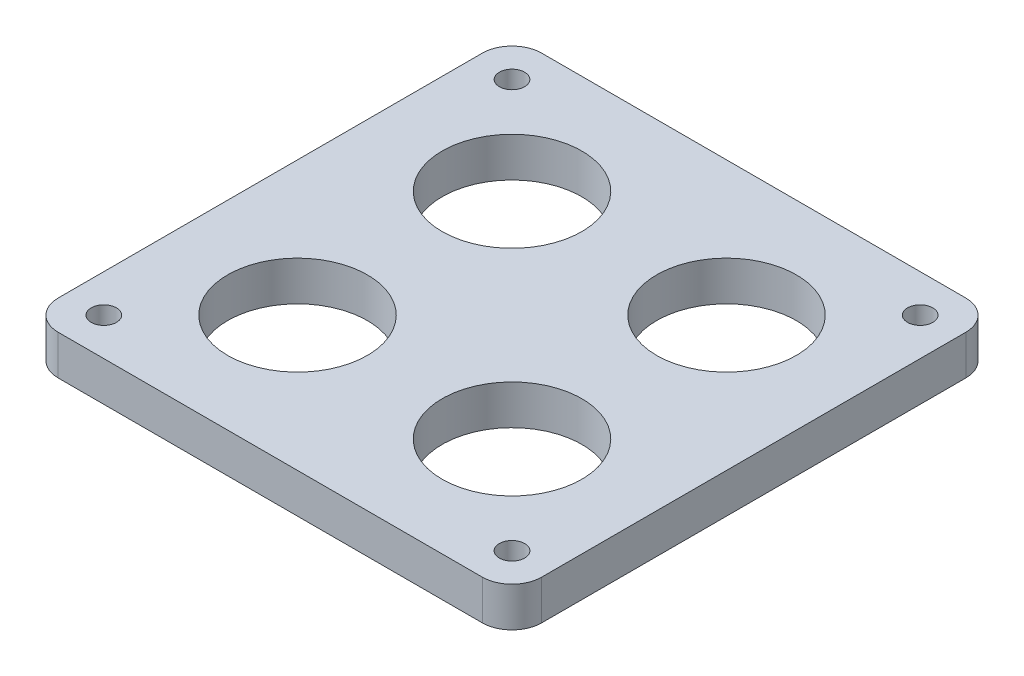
ISO-10303-21;
HEADER;
FILE_DESCRIPTION(('STEP AP214'),'2;1');
FILE_NAME('part.step','',(''),(''),'','','');
FILE_SCHEMA(('AUTOMOTIVE_DESIGN { 1 0 10303 214 1 1 1 1 }'));
ENDSEC;
DATA;
#1=APPLICATION_CONTEXT('core data for automotive mechanical design processes');
#2=APPLICATION_PROTOCOL_DEFINITION('international standard','automotive_design',2000,#1);
#3=PRODUCT_CONTEXT('',#1,'mechanical');
#4=PRODUCT('Part','Part','',(#3));
#5=PRODUCT_RELATED_PRODUCT_CATEGORY('part','',(#4));
#6=PRODUCT_DEFINITION_FORMATION('','',#4);
#7=PRODUCT_DEFINITION_CONTEXT('part definition',#1,'design');
#8=PRODUCT_DEFINITION('design','',#6,#7);
#9=PRODUCT_DEFINITION_SHAPE('','',#8);
#10=(LENGTH_UNIT() NAMED_UNIT(*) SI_UNIT(.MILLI.,.METRE.));
#11=(NAMED_UNIT(*) PLANE_ANGLE_UNIT() SI_UNIT($,.RADIAN.));
#12=(NAMED_UNIT(*) SI_UNIT($,.STERADIAN.) SOLID_ANGLE_UNIT());
#13=UNCERTAINTY_MEASURE_WITH_UNIT(LENGTH_MEASURE(1.E-05),#10,'distance_accuracy_value','');
#14=(GEOMETRIC_REPRESENTATION_CONTEXT(3) GLOBAL_UNCERTAINTY_ASSIGNED_CONTEXT((#13)) GLOBAL_UNIT_ASSIGNED_CONTEXT((#10,
#11,#12)) REPRESENTATION_CONTEXT('',''));
#15=CARTESIAN_POINT('',(0.,0.,0.));
#16=DIRECTION('',(0.,0.,1.));
#17=DIRECTION('',(1.,0.,0.));
#18=AXIS2_PLACEMENT_3D('',#15,#16,#17);
#19=CARTESIAN_POINT('',(0.,-2.,0.));
#20=DIRECTION('',(0.,1.,0.));
#21=DIRECTION('',(0.,0.,1.));
#22=AXIS2_PLACEMENT_3D('',#19,#20,#21);
#23=PLANE('',#22);
#24=CARTESIAN_POINT('',(-10.825,-2.,-10.825));
#25=DIRECTION('',(0.,1.,0.));
#26=DIRECTION('',(0.,0.,1.));
#27=AXIS2_PLACEMENT_3D('',#24,#25,#26);
#28=CIRCLE('',#27,7.05);
#29=CARTESIAN_POINT('',(-10.825,-2.,-3.775));
#30=VERTEX_POINT('',#29);
#31=EDGE_CURVE('P0_E183',#30,#30,#28,.T.);
#32=ORIENTED_EDGE('',*,*,#31,.T.);
#33=EDGE_LOOP('',(#32));
#34=FACE_BOUND('',#33,.T.);
#35=CARTESIAN_POINT('',(10.825,-2.,-10.825));
#36=DIRECTION('',(0.,1.,0.));
#37=DIRECTION('',(0.,0.,1.));
#38=AXIS2_PLACEMENT_3D('',#35,#36,#37);
#39=CIRCLE('',#38,7.05);
#40=CARTESIAN_POINT('',(10.825,-2.,-3.775));
#41=VERTEX_POINT('',#40);
#42=EDGE_CURVE('P0_E187',#41,#41,#39,.T.);
#43=ORIENTED_EDGE('',*,*,#42,.T.);
#44=EDGE_LOOP('',(#43));
#45=FACE_BOUND('',#44,.T.);
#46=CARTESIAN_POINT('',(10.825,-2.,10.825));
#47=DIRECTION('',(0.,1.,0.));
#48=DIRECTION('',(0.,0.,1.));
#49=AXIS2_PLACEMENT_3D('',#46,#47,#48);
#50=CIRCLE('',#49,7.05);
#51=CARTESIAN_POINT('',(10.825,-2.,17.875));
#52=VERTEX_POINT('',#51);
#53=EDGE_CURVE('P0_E191',#52,#52,#50,.T.);
#54=ORIENTED_EDGE('',*,*,#53,.T.);
#55=EDGE_LOOP('',(#54));
#56=FACE_BOUND('',#55,.T.);
#57=CARTESIAN_POINT('',(-10.825,-2.,10.825));
#58=DIRECTION('',(0.,1.,0.));
#59=DIRECTION('',(0.,0.,1.));
#60=AXIS2_PLACEMENT_3D('',#57,#58,#59);
#61=CIRCLE('',#60,7.05);
#62=CARTESIAN_POINT('',(-10.825,-2.,17.875));
#63=VERTEX_POINT('',#62);
#64=EDGE_CURVE('P0_E195',#63,#63,#61,.T.);
#65=ORIENTED_EDGE('',*,*,#64,.T.);
#66=EDGE_LOOP('',(#65));
#67=FACE_BOUND('',#66,.T.);
#68=CARTESIAN_POINT('',(-20.6,-2.,-20.6));
#69=DIRECTION('',(0.,1.,0.));
#70=DIRECTION('',(0.,0.,1.));
#71=AXIS2_PLACEMENT_3D('',#68,#69,#70);
#72=CIRCLE('',#71,1.275);
#73=CARTESIAN_POINT('',(-20.6,-2.,-19.325));
#74=VERTEX_POINT('',#73);
#75=EDGE_CURVE('P0_E199',#74,#74,#72,.T.);
#76=ORIENTED_EDGE('',*,*,#75,.T.);
#77=EDGE_LOOP('',(#76));
#78=FACE_BOUND('',#77,.T.);
#79=CARTESIAN_POINT('',(-20.6,-2.,20.6));
#80=DIRECTION('',(0.,1.,0.));
#81=DIRECTION('',(0.,0.,1.));
#82=AXIS2_PLACEMENT_3D('',#79,#80,#81);
#83=CIRCLE('',#82,1.275);
#84=CARTESIAN_POINT('',(-20.6,-2.,21.875));
#85=VERTEX_POINT('',#84);
#86=EDGE_CURVE('P0_E203',#85,#85,#83,.T.);
#87=ORIENTED_EDGE('',*,*,#86,.T.);
#88=EDGE_LOOP('',(#87));
#89=FACE_BOUND('',#88,.T.);
#90=CARTESIAN_POINT('',(20.6,-2.,20.6));
#91=DIRECTION('',(0.,1.,0.));
#92=DIRECTION('',(0.,0.,1.));
#93=AXIS2_PLACEMENT_3D('',#90,#91,#92);
#94=CIRCLE('',#93,1.275);
#95=CARTESIAN_POINT('',(20.6,-2.,21.875));
#96=VERTEX_POINT('',#95);
#97=EDGE_CURVE('P0_E207',#96,#96,#94,.T.);
#98=ORIENTED_EDGE('',*,*,#97,.T.);
#99=EDGE_LOOP('',(#98));
#100=FACE_BOUND('',#99,.T.);
#101=CARTESIAN_POINT('',(20.6,-2.,-20.6));
#102=DIRECTION('',(0.,1.,0.));
#103=DIRECTION('',(0.,0.,1.));
#104=AXIS2_PLACEMENT_3D('',#101,#102,#103);
#105=CIRCLE('',#104,1.275);
#106=CARTESIAN_POINT('',(20.6,-2.,-19.325));
#107=VERTEX_POINT('',#106);
#108=EDGE_CURVE('P0_E211',#107,#107,#105,.T.);
#109=ORIENTED_EDGE('',*,*,#108,.T.);
#110=EDGE_LOOP('',(#109));
#111=FACE_BOUND('',#110,.T.);
#112=CARTESIAN_POINT('',(21.4,-2.,-21.4));
#113=DIRECTION('',(0.,1.,0.));
#114=DIRECTION('',(0.,0.,1.));
#115=AXIS2_PLACEMENT_3D('',#112,#113,#114);
#116=CIRCLE('',#115,3.);
#117=CARTESIAN_POINT('',(24.4,-2.,-21.4));
#118=VERTEX_POINT('',#117);
#119=CARTESIAN_POINT('',(21.4,-2.,-24.4));
#120=VERTEX_POINT('',#119);
#121=EDGE_CURVE('P0_E219',#118,#120,#116,.T.);
#122=ORIENTED_EDGE('',*,*,#121,.F.);
#123=DIRECTION('',(0.,0.,-1.));
#124=VECTOR('',#123,1.);
#125=CARTESIAN_POINT('',(24.4,-2.,21.4));
#126=LINE('',#125,#124);
#127=CARTESIAN_POINT('',(24.4,-2.,21.4));
#128=VERTEX_POINT('',#127);
#129=EDGE_CURVE('P0_E136',#128,#118,#126,.T.);
#130=ORIENTED_EDGE('',*,*,#129,.F.);
#131=CARTESIAN_POINT('',(21.4,-2.,21.4));
#132=DIRECTION('',(0.,1.,0.));
#133=DIRECTION('',(0.,0.,1.));
#134=AXIS2_PLACEMENT_3D('',#131,#132,#133);
#135=CIRCLE('',#134,3.);
#136=CARTESIAN_POINT('',(21.4,-2.,24.4));
#137=VERTEX_POINT('',#136);
#138=EDGE_CURVE('P0_E110',#137,#128,#135,.T.);
#139=ORIENTED_EDGE('',*,*,#138,.F.);
#140=DIRECTION('',(1.,0.,0.));
#141=VECTOR('',#140,1.);
#142=CARTESIAN_POINT('',(-21.4,-2.,24.4));
#143=LINE('',#142,#141);
#144=CARTESIAN_POINT('',(-21.4,-2.,24.4));
#145=VERTEX_POINT('',#144);
#146=EDGE_CURVE('P0_E107',#145,#137,#143,.T.);
#147=ORIENTED_EDGE('',*,*,#146,.F.);
#148=CARTESIAN_POINT('',(-21.4,-2.,21.4));
#149=DIRECTION('',(0.,1.,0.));
#150=DIRECTION('',(0.,0.,1.));
#151=AXIS2_PLACEMENT_3D('',#148,#149,#150);
#152=CIRCLE('',#151,3.);
#153=CARTESIAN_POINT('',(-24.4,-2.,21.4));
#154=VERTEX_POINT('',#153);
#155=EDGE_CURVE('P0_E20',#154,#145,#152,.T.);
#156=ORIENTED_EDGE('',*,*,#155,.F.);
#157=DIRECTION('',(0.,0.,1.));
#158=VECTOR('',#157,1.);
#159=CARTESIAN_POINT('',(-24.4,-2.,-21.4));
#160=LINE('',#159,#158);
#161=CARTESIAN_POINT('',(-24.4,-2.,-21.4));
#162=VERTEX_POINT('',#161);
#163=EDGE_CURVE('P0_E91',#162,#154,#160,.T.);
#164=ORIENTED_EDGE('',*,*,#163,.F.);
#165=CARTESIAN_POINT('',(-21.4,-2.,-21.4));
#166=DIRECTION('',(0.,1.,0.));
#167=DIRECTION('',(0.,0.,1.));
#168=AXIS2_PLACEMENT_3D('',#165,#166,#167);
#169=CIRCLE('',#168,3.);
#170=CARTESIAN_POINT('',(-21.4,-2.,-24.4));
#171=VERTEX_POINT('',#170);
#172=EDGE_CURVE('P0_E215',#171,#162,#169,.T.);
#173=ORIENTED_EDGE('',*,*,#172,.F.);
#174=DIRECTION('',(-1.,0.,0.));
#175=VECTOR('',#174,1.);
#176=CARTESIAN_POINT('',(21.4,-2.,-24.4));
#177=LINE('',#176,#175);
#178=EDGE_CURVE('P0_E129',#120,#171,#177,.T.);
#179=ORIENTED_EDGE('',*,*,#178,.F.);
#180=EDGE_LOOP('',(#122,#130,#139,#147,#156,#164,#173,#179));
#181=FACE_BOUND('',#180,.T.);
#182=ADVANCED_FACE('P0_F17',(#34,#45,#56,#67,#78,#89,#100,#111,#181),#23,.F.);
#183=CARTESIAN_POINT('',(-24.4,-2.,-21.4));
#184=DIRECTION('',(-1.,0.,0.));
#185=DIRECTION('',(0.,0.,1.));
#186=AXIS2_PLACEMENT_3D('',#183,#184,#185);
#187=PLANE('',#186);
#188=DIRECTION('',(0.,1.,0.));
#189=VECTOR('',#188,1.);
#190=CARTESIAN_POINT('',(-24.4,-2.,-21.4));
#191=LINE('',#190,#189);
#192=CARTESIAN_POINT('',(-24.4,2.,-21.4));
#193=VERTEX_POINT('',#192);
#194=EDGE_CURVE('P0_E132',#162,#193,#191,.T.);
#195=ORIENTED_EDGE('',*,*,#194,.F.);
#196=ORIENTED_EDGE('',*,*,#163,.T.);
#197=DIRECTION('',(0.,1.,0.));
#198=VECTOR('',#197,1.);
#199=CARTESIAN_POINT('',(-24.4,-2.,21.4));
#200=LINE('',#199,#198);
#201=CARTESIAN_POINT('',(-24.4,2.,21.4));
#202=VERTEX_POINT('',#201);
#203=EDGE_CURVE('P0_E103',#202,#154,#200,.F.);
#204=ORIENTED_EDGE('',*,*,#203,.F.);
#205=DIRECTION('',(0.,0.,1.));
#206=VECTOR('',#205,1.);
#207=CARTESIAN_POINT('',(-24.4,2.,0.));
#208=LINE('',#207,#206);
#209=EDGE_CURVE('P0_E182',#193,#202,#208,.T.);
#210=ORIENTED_EDGE('',*,*,#209,.F.);
#211=EDGE_LOOP('',(#195,#196,#204,#210));
#212=FACE_BOUND('',#211,.T.);
#213=ADVANCED_FACE('P0_F264',(#212),#187,.T.);
#214=CARTESIAN_POINT('',(-21.4,-2.,21.4));
#215=DIRECTION('',(0.,1.,0.));
#216=DIRECTION('',(0.,0.,1.));
#217=AXIS2_PLACEMENT_3D('',#214,#215,#216);
#218=CYLINDRICAL_SURFACE('',#217,3.);
#219=ORIENTED_EDGE('',*,*,#203,.T.);
#220=ORIENTED_EDGE('',*,*,#155,.T.);
#221=DIRECTION('',(0.,1.,0.));
#222=VECTOR('',#221,1.);
#223=CARTESIAN_POINT('',(-21.4,-2.,24.4));
#224=LINE('',#223,#222);
#225=CARTESIAN_POINT('',(-21.4,2.,24.4));
#226=VERTEX_POINT('',#225);
#227=EDGE_CURVE('P0_E101',#226,#145,#224,.F.);
#228=ORIENTED_EDGE('',*,*,#227,.F.);
#229=CARTESIAN_POINT('',(-21.4,2.,21.4));
#230=DIRECTION('',(0.,1.,0.));
#231=DIRECTION('',(0.,0.,1.));
#232=AXIS2_PLACEMENT_3D('',#229,#230,#231);
#233=CIRCLE('',#232,3.);
#234=EDGE_CURVE('P0_E180',#202,#226,#233,.T.);
#235=ORIENTED_EDGE('',*,*,#234,.F.);
#236=EDGE_LOOP('',(#219,#220,#228,#235));
#237=FACE_BOUND('',#236,.T.);
#238=ADVANCED_FACE('P0_F98',(#237),#218,.T.);
#239=CARTESIAN_POINT('',(-21.4,-2.,24.4));
#240=DIRECTION('',(0.,0.,1.));
#241=DIRECTION('',(1.,0.,0.));
#242=AXIS2_PLACEMENT_3D('',#239,#240,#241);
#243=PLANE('',#242);
#244=ORIENTED_EDGE('',*,*,#227,.T.);
#245=ORIENTED_EDGE('',*,*,#146,.T.);
#246=DIRECTION('',(0.,1.,0.));
#247=VECTOR('',#246,1.);
#248=CARTESIAN_POINT('',(21.4,-2.,24.4));
#249=LINE('',#248,#247);
#250=CARTESIAN_POINT('',(21.4,2.,24.4));
#251=VERTEX_POINT('',#250);
#252=EDGE_CURVE('P0_E114',#251,#137,#249,.F.);
#253=ORIENTED_EDGE('',*,*,#252,.F.);
#254=DIRECTION('',(1.,0.,0.));
#255=VECTOR('',#254,1.);
#256=CARTESIAN_POINT('',(0.,2.,24.4));
#257=LINE('',#256,#255);
#258=EDGE_CURVE('P0_E118',#226,#251,#257,.T.);
#259=ORIENTED_EDGE('',*,*,#258,.F.);
#260=EDGE_LOOP('',(#244,#245,#253,#259));
#261=FACE_BOUND('',#260,.T.);
#262=ADVANCED_FACE('P0_F116',(#261),#243,.T.);
#263=CARTESIAN_POINT('',(21.4,-2.,21.4));
#264=DIRECTION('',(0.,1.,0.));
#265=DIRECTION('',(0.,0.,1.));
#266=AXIS2_PLACEMENT_3D('',#263,#264,#265);
#267=CYLINDRICAL_SURFACE('',#266,3.);
#268=ORIENTED_EDGE('',*,*,#252,.T.);
#269=ORIENTED_EDGE('',*,*,#138,.T.);
#270=DIRECTION('',(0.,1.,0.));
#271=VECTOR('',#270,1.);
#272=CARTESIAN_POINT('',(24.4,-2.,21.4));
#273=LINE('',#272,#271);
#274=CARTESIAN_POINT('',(24.4,2.,21.4));
#275=VERTEX_POINT('',#274);
#276=EDGE_CURVE('P0_E139',#275,#128,#273,.F.);
#277=ORIENTED_EDGE('',*,*,#276,.F.);
#278=CARTESIAN_POINT('',(21.4,2.,21.4));
#279=DIRECTION('',(0.,1.,0.));
#280=DIRECTION('',(0.,0.,1.));
#281=AXIS2_PLACEMENT_3D('',#278,#279,#280);
#282=CIRCLE('',#281,3.);
#283=EDGE_CURVE('P0_E177',#251,#275,#282,.T.);
#284=ORIENTED_EDGE('',*,*,#283,.F.);
#285=EDGE_LOOP('',(#268,#269,#277,#284));
#286=FACE_BOUND('',#285,.T.);
#287=ADVANCED_FACE('P0_F227',(#286),#267,.T.);
#288=CARTESIAN_POINT('',(24.4,-2.,21.4));
#289=DIRECTION('',(1.,0.,0.));
#290=DIRECTION('',(0.,0.,-1.));
#291=AXIS2_PLACEMENT_3D('',#288,#289,#290);
#292=PLANE('',#291);
#293=ORIENTED_EDGE('',*,*,#276,.T.);
#294=ORIENTED_EDGE('',*,*,#129,.T.);
#295=DIRECTION('',(0.,1.,0.));
#296=VECTOR('',#295,1.);
#297=CARTESIAN_POINT('',(24.4,-2.,-21.4));
#298=LINE('',#297,#296);
#299=CARTESIAN_POINT('',(24.4,2.,-21.4));
#300=VERTEX_POINT('',#299);
#301=EDGE_CURVE('P0_E138',#300,#118,#298,.F.);
#302=ORIENTED_EDGE('',*,*,#301,.F.);
#303=DIRECTION('',(0.,0.,1.));
#304=VECTOR('',#303,1.);
#305=CARTESIAN_POINT('',(24.4,2.,0.));
#306=LINE('',#305,#304);
#307=EDGE_CURVE('P0_E176',#275,#300,#306,.F.);
#308=ORIENTED_EDGE('',*,*,#307,.F.);
#309=EDGE_LOOP('',(#293,#294,#302,#308));
#310=FACE_BOUND('',#309,.T.);
#311=ADVANCED_FACE('P0_F255',(#310),#292,.T.);
#312=CARTESIAN_POINT('',(21.4,-2.,-21.4));
#313=DIRECTION('',(0.,1.,0.));
#314=DIRECTION('',(0.,0.,1.));
#315=AXIS2_PLACEMENT_3D('',#312,#313,#314);
#316=CYLINDRICAL_SURFACE('',#315,3.);
#317=ORIENTED_EDGE('',*,*,#301,.T.);
#318=ORIENTED_EDGE('',*,*,#121,.T.);
#319=DIRECTION('',(0.,1.,0.));
#320=VECTOR('',#319,1.);
#321=CARTESIAN_POINT('',(21.4,-2.,-24.4));
#322=LINE('',#321,#320);
#323=CARTESIAN_POINT('',(21.4,2.,-24.4));
#324=VERTEX_POINT('',#323);
#325=EDGE_CURVE('P0_E133',#324,#120,#322,.F.);
#326=ORIENTED_EDGE('',*,*,#325,.F.);
#327=CARTESIAN_POINT('',(21.4,2.,-21.4));
#328=DIRECTION('',(0.,1.,0.));
#329=DIRECTION('',(0.,0.,1.));
#330=AXIS2_PLACEMENT_3D('',#327,#328,#329);
#331=CIRCLE('',#330,3.);
#332=EDGE_CURVE('P0_E172',#300,#324,#331,.T.);
#333=ORIENTED_EDGE('',*,*,#332,.F.);
#334=EDGE_LOOP('',(#317,#318,#326,#333));
#335=FACE_BOUND('',#334,.T.);
#336=ADVANCED_FACE('P0_F252',(#335),#316,.T.);
#337=CARTESIAN_POINT('',(21.4,-2.,-24.4));
#338=DIRECTION('',(0.,0.,-1.));
#339=DIRECTION('',(-1.,0.,0.));
#340=AXIS2_PLACEMENT_3D('',#337,#338,#339);
#341=PLANE('',#340);
#342=ORIENTED_EDGE('',*,*,#325,.T.);
#343=ORIENTED_EDGE('',*,*,#178,.T.);
#344=DIRECTION('',(0.,1.,0.));
#345=VECTOR('',#344,1.);
#346=CARTESIAN_POINT('',(-21.4,-2.,-24.4));
#347=LINE('',#346,#345);
#348=CARTESIAN_POINT('',(-21.4,2.,-24.4));
#349=VERTEX_POINT('',#348);
#350=EDGE_CURVE('P0_E40',#349,#171,#347,.F.);
#351=ORIENTED_EDGE('',*,*,#350,.F.);
#352=DIRECTION('',(1.,0.,0.));
#353=VECTOR('',#352,1.);
#354=CARTESIAN_POINT('',(0.,2.,-24.4));
#355=LINE('',#354,#353);
#356=EDGE_CURVE('P0_E171',#324,#349,#355,.F.);
#357=ORIENTED_EDGE('',*,*,#356,.F.);
#358=EDGE_LOOP('',(#342,#343,#351,#357));
#359=FACE_BOUND('',#358,.T.);
#360=ADVANCED_FACE('P0_F257',(#359),#341,.T.);
#361=CARTESIAN_POINT('',(-21.4,-2.,-21.4));
#362=DIRECTION('',(0.,1.,0.));
#363=DIRECTION('',(0.,0.,1.));
#364=AXIS2_PLACEMENT_3D('',#361,#362,#363);
#365=CYLINDRICAL_SURFACE('',#364,3.);
#366=ORIENTED_EDGE('',*,*,#350,.T.);
#367=ORIENTED_EDGE('',*,*,#172,.T.);
#368=ORIENTED_EDGE('',*,*,#194,.T.);
#369=CARTESIAN_POINT('',(-21.4,2.,-21.4));
#370=DIRECTION('',(0.,1.,0.));
#371=DIRECTION('',(0.,0.,1.));
#372=AXIS2_PLACEMENT_3D('',#369,#370,#371);
#373=CIRCLE('',#372,3.);
#374=EDGE_CURVE('P0_E167',#349,#193,#373,.T.);
#375=ORIENTED_EDGE('',*,*,#374,.F.);
#376=EDGE_LOOP('',(#366,#367,#368,#375));
#377=FACE_BOUND('',#376,.T.);
#378=ADVANCED_FACE('P0_F263',(#377),#365,.T.);
#379=CARTESIAN_POINT('',(20.6,-2.,-20.6));
#380=DIRECTION('',(0.,1.,0.));
#381=DIRECTION('',(0.,0.,1.));
#382=AXIS2_PLACEMENT_3D('',#379,#380,#381);
#383=CYLINDRICAL_SURFACE('',#382,1.275);
#384=CARTESIAN_POINT('',(20.6,2.,-20.6));
#385=DIRECTION('',(0.,1.,0.));
#386=DIRECTION('',(0.,0.,1.));
#387=AXIS2_PLACEMENT_3D('',#384,#385,#386);
#388=CIRCLE('',#387,1.275);
#389=CARTESIAN_POINT('',(20.6,2.,-19.325));
#390=VERTEX_POINT('',#389);
#391=EDGE_CURVE('P0_E163',#390,#390,#388,.F.);
#392=ORIENTED_EDGE('',*,*,#391,.F.);
#393=EDGE_LOOP('',(#392));
#394=FACE_BOUND('',#393,.T.);
#395=ORIENTED_EDGE('',*,*,#108,.F.);
#396=EDGE_LOOP('',(#395));
#397=FACE_BOUND('',#396,.T.);
#398=ADVANCED_FACE('P0_F305',(#394,#397),#383,.F.);
#399=CARTESIAN_POINT('',(20.6,-2.,20.6));
#400=DIRECTION('',(0.,1.,0.));
#401=DIRECTION('',(0.,0.,1.));
#402=AXIS2_PLACEMENT_3D('',#399,#400,#401);
#403=CYLINDRICAL_SURFACE('',#402,1.275);
#404=CARTESIAN_POINT('',(20.6,2.,20.6));
#405=DIRECTION('',(0.,1.,0.));
#406=DIRECTION('',(0.,0.,1.));
#407=AXIS2_PLACEMENT_3D('',#404,#405,#406);
#408=CIRCLE('',#407,1.275);
#409=CARTESIAN_POINT('',(20.6,2.,21.875));
#410=VERTEX_POINT('',#409);
#411=EDGE_CURVE('P0_E160',#410,#410,#408,.F.);
#412=ORIENTED_EDGE('',*,*,#411,.F.);
#413=EDGE_LOOP('',(#412));
#414=FACE_BOUND('',#413,.T.);
#415=ORIENTED_EDGE('',*,*,#97,.F.);
#416=EDGE_LOOP('',(#415));
#417=FACE_BOUND('',#416,.T.);
#418=ADVANCED_FACE('P0_F301',(#414,#417),#403,.F.);
#419=CARTESIAN_POINT('',(-20.6,-2.,20.6));
#420=DIRECTION('',(0.,1.,0.));
#421=DIRECTION('',(0.,0.,1.));
#422=AXIS2_PLACEMENT_3D('',#419,#420,#421);
#423=CYLINDRICAL_SURFACE('',#422,1.275);
#424=CARTESIAN_POINT('',(-20.6,2.,20.6));
#425=DIRECTION('',(0.,1.,0.));
#426=DIRECTION('',(0.,0.,1.));
#427=AXIS2_PLACEMENT_3D('',#424,#425,#426);
#428=CIRCLE('',#427,1.275);
#429=CARTESIAN_POINT('',(-20.6,2.,21.875));
#430=VERTEX_POINT('',#429);
#431=EDGE_CURVE('P0_E156',#430,#430,#428,.F.);
#432=ORIENTED_EDGE('',*,*,#431,.F.);
#433=EDGE_LOOP('',(#432));
#434=FACE_BOUND('',#433,.T.);
#435=ORIENTED_EDGE('',*,*,#86,.F.);
#436=EDGE_LOOP('',(#435));
#437=FACE_BOUND('',#436,.T.);
#438=ADVANCED_FACE('P0_F297',(#434,#437),#423,.F.);
#439=CARTESIAN_POINT('',(-20.6,-2.,-20.6));
#440=DIRECTION('',(0.,1.,0.));
#441=DIRECTION('',(0.,0.,1.));
#442=AXIS2_PLACEMENT_3D('',#439,#440,#441);
#443=CYLINDRICAL_SURFACE('',#442,1.275);
#444=CARTESIAN_POINT('',(-20.6,2.,-20.6));
#445=DIRECTION('',(0.,1.,0.));
#446=DIRECTION('',(0.,0.,1.));
#447=AXIS2_PLACEMENT_3D('',#444,#445,#446);
#448=CIRCLE('',#447,1.275);
#449=CARTESIAN_POINT('',(-20.6,2.,-19.325));
#450=VERTEX_POINT('',#449);
#451=EDGE_CURVE('P0_E152',#450,#450,#448,.F.);
#452=ORIENTED_EDGE('',*,*,#451,.F.);
#453=EDGE_LOOP('',(#452));
#454=FACE_BOUND('',#453,.T.);
#455=ORIENTED_EDGE('',*,*,#75,.F.);
#456=EDGE_LOOP('',(#455));
#457=FACE_BOUND('',#456,.T.);
#458=ADVANCED_FACE('P0_F293',(#454,#457),#443,.F.);
#459=CARTESIAN_POINT('',(-10.825,-2.,10.825));
#460=DIRECTION('',(0.,1.,0.));
#461=DIRECTION('',(0.,0.,1.));
#462=AXIS2_PLACEMENT_3D('',#459,#460,#461);
#463=CYLINDRICAL_SURFACE('',#462,7.05);
#464=CARTESIAN_POINT('',(-10.825,2.,10.825));
#465=DIRECTION('',(0.,1.,0.));
#466=DIRECTION('',(0.,0.,1.));
#467=AXIS2_PLACEMENT_3D('',#464,#465,#466);
#468=CIRCLE('',#467,7.05);
#469=CARTESIAN_POINT('',(-10.825,2.,17.875));
#470=VERTEX_POINT('',#469);
#471=EDGE_CURVE('P0_E148',#470,#470,#468,.F.);
#472=ORIENTED_EDGE('',*,*,#471,.F.);
#473=EDGE_LOOP('',(#472));
#474=FACE_BOUND('',#473,.T.);
#475=ORIENTED_EDGE('',*,*,#64,.F.);
#476=EDGE_LOOP('',(#475));
#477=FACE_BOUND('',#476,.T.);
#478=ADVANCED_FACE('P0_F289',(#474,#477),#463,.F.);
#479=CARTESIAN_POINT('',(10.825,-2.,10.825));
#480=DIRECTION('',(0.,1.,0.));
#481=DIRECTION('',(0.,0.,1.));
#482=AXIS2_PLACEMENT_3D('',#479,#480,#481);
#483=CYLINDRICAL_SURFACE('',#482,7.05);
#484=CARTESIAN_POINT('',(10.825,2.,10.825));
#485=DIRECTION('',(0.,1.,0.));
#486=DIRECTION('',(0.,0.,1.));
#487=AXIS2_PLACEMENT_3D('',#484,#485,#486);
#488=CIRCLE('',#487,7.05);
#489=CARTESIAN_POINT('',(10.825,2.,17.875));
#490=VERTEX_POINT('',#489);
#491=EDGE_CURVE('P0_E144',#490,#490,#488,.F.);
#492=ORIENTED_EDGE('',*,*,#491,.F.);
#493=EDGE_LOOP('',(#492));
#494=FACE_BOUND('',#493,.T.);
#495=ORIENTED_EDGE('',*,*,#53,.F.);
#496=EDGE_LOOP('',(#495));
#497=FACE_BOUND('',#496,.T.);
#498=ADVANCED_FACE('P0_F285',(#494,#497),#483,.F.);
#499=CARTESIAN_POINT('',(10.825,-2.,-10.825));
#500=DIRECTION('',(0.,1.,0.));
#501=DIRECTION('',(0.,0.,1.));
#502=AXIS2_PLACEMENT_3D('',#499,#500,#501);
#503=CYLINDRICAL_SURFACE('',#502,7.05);
#504=CARTESIAN_POINT('',(10.825,2.,-10.825));
#505=DIRECTION('',(0.,1.,0.));
#506=DIRECTION('',(0.,0.,1.));
#507=AXIS2_PLACEMENT_3D('',#504,#505,#506);
#508=CIRCLE('',#507,7.05);
#509=CARTESIAN_POINT('',(10.825,2.,-3.775));
#510=VERTEX_POINT('',#509);
#511=EDGE_CURVE('P0_E27',#510,#510,#508,.F.);
#512=ORIENTED_EDGE('',*,*,#511,.F.);
#513=EDGE_LOOP('',(#512));
#514=FACE_BOUND('',#513,.T.);
#515=ORIENTED_EDGE('',*,*,#42,.F.);
#516=EDGE_LOOP('',(#515));
#517=FACE_BOUND('',#516,.T.);
#518=ADVANCED_FACE('P0_F278',(#514,#517),#503,.F.);
#519=CARTESIAN_POINT('',(-10.825,-2.,-10.825));
#520=DIRECTION('',(0.,1.,0.));
#521=DIRECTION('',(0.,0.,1.));
#522=AXIS2_PLACEMENT_3D('',#519,#520,#521);
#523=CYLINDRICAL_SURFACE('',#522,7.05);
#524=CARTESIAN_POINT('',(-10.825,2.,-10.825));
#525=DIRECTION('',(0.,1.,0.));
#526=DIRECTION('',(0.,0.,1.));
#527=AXIS2_PLACEMENT_3D('',#524,#525,#526);
#528=CIRCLE('',#527,7.05);
#529=CARTESIAN_POINT('',(-10.825,2.,-3.775));
#530=VERTEX_POINT('',#529);
#531=EDGE_CURVE('P0_E11',#530,#530,#528,.F.);
#532=ORIENTED_EDGE('',*,*,#531,.F.);
#533=EDGE_LOOP('',(#532));
#534=FACE_BOUND('',#533,.T.);
#535=ORIENTED_EDGE('',*,*,#31,.F.);
#536=EDGE_LOOP('',(#535));
#537=FACE_BOUND('',#536,.T.);
#538=ADVANCED_FACE('P0_F273',(#534,#537),#523,.F.);
#539=CARTESIAN_POINT('',(0.,2.,0.));
#540=DIRECTION('',(0.,1.,0.));
#541=DIRECTION('',(0.,0.,1.));
#542=AXIS2_PLACEMENT_3D('',#539,#540,#541);
#543=PLANE('',#542);
#544=ORIENTED_EDGE('',*,*,#531,.T.);
#545=EDGE_LOOP('',(#544));
#546=FACE_BOUND('',#545,.T.);
#547=ORIENTED_EDGE('',*,*,#511,.T.);
#548=EDGE_LOOP('',(#547));
#549=FACE_BOUND('',#548,.T.);
#550=ORIENTED_EDGE('',*,*,#491,.T.);
#551=EDGE_LOOP('',(#550));
#552=FACE_BOUND('',#551,.T.);
#553=ORIENTED_EDGE('',*,*,#471,.T.);
#554=EDGE_LOOP('',(#553));
#555=FACE_BOUND('',#554,.T.);
#556=ORIENTED_EDGE('',*,*,#451,.T.);
#557=EDGE_LOOP('',(#556));
#558=FACE_BOUND('',#557,.T.);
#559=ORIENTED_EDGE('',*,*,#431,.T.);
#560=EDGE_LOOP('',(#559));
#561=FACE_BOUND('',#560,.T.);
#562=ORIENTED_EDGE('',*,*,#411,.T.);
#563=EDGE_LOOP('',(#562));
#564=FACE_BOUND('',#563,.T.);
#565=ORIENTED_EDGE('',*,*,#391,.T.);
#566=EDGE_LOOP('',(#565));
#567=FACE_BOUND('',#566,.T.);
#568=ORIENTED_EDGE('',*,*,#356,.T.);
#569=ORIENTED_EDGE('',*,*,#374,.T.);
#570=ORIENTED_EDGE('',*,*,#209,.T.);
#571=ORIENTED_EDGE('',*,*,#234,.T.);
#572=ORIENTED_EDGE('',*,*,#258,.T.);
#573=ORIENTED_EDGE('',*,*,#283,.T.);
#574=ORIENTED_EDGE('',*,*,#307,.T.);
#575=ORIENTED_EDGE('',*,*,#332,.T.);
#576=EDGE_LOOP('',(#568,#569,#570,#571,#572,#573,#574,#575));
#577=FACE_BOUND('',#576,.T.);
#578=ADVANCED_FACE('P0_F232',(#546,#549,#552,#555,#558,#561,#564,#567,#577),#543,.T.);
#579=CLOSED_SHELL('',(#182,#213,#238,#262,#287,#311,#336,#360,#378,#398,#418,#438,#458,#478,
#498,#518,#538,#578));
#580=MANIFOLD_SOLID_BREP('P0_B1',#579);
#581=CARTESIAN_POINT('',(20.6,2.,-20.6));
#582=DIRECTION('',(0.,-1.,0.));
#583=DIRECTION('',(0.,0.,-1.));
#584=AXIS2_PLACEMENT_3D('',#581,#582,#583);
#585=CYLINDRICAL_SURFACE('',#584,1.5);
#586=CARTESIAN_POINT('',(20.6,-2.,-20.6));
#587=DIRECTION('',(0.,-1.,0.));
#588=DIRECTION('',(0.,0.,-1.));
#589=AXIS2_PLACEMENT_3D('',#586,#587,#588);
#590=CIRCLE('',#589,1.5);
#591=CARTESIAN_POINT('',(20.6,-2.,-22.1));
#592=VERTEX_POINT('',#591);
#593=EDGE_CURVE('P1_E16',#592,#592,#590,.F.);
#594=ORIENTED_EDGE('',*,*,#593,.T.);
#595=EDGE_LOOP('',(#594));
#596=FACE_BOUND('',#595,.T.);
#597=CARTESIAN_POINT('',(20.6,2.,-20.6));
#598=DIRECTION('',(0.,-1.,0.));
#599=DIRECTION('',(0.,0.,-1.));
#600=AXIS2_PLACEMENT_3D('',#597,#598,#599);
#601=CIRCLE('',#600,1.5);
#602=CARTESIAN_POINT('',(20.6,2.,-22.1));
#603=VERTEX_POINT('',#602);
#604=EDGE_CURVE('P1_E10',#603,#603,#601,.T.);
#605=ORIENTED_EDGE('',*,*,#604,.T.);
#606=EDGE_LOOP('',(#605));
#607=FACE_BOUND('',#606,.T.);
#608=ADVANCED_FACE('P1_F15',(#596,#607),#585,.T.);
#609=OPEN_SHELL('',(#608));
#610=SHELL_BASED_SURFACE_MODEL('P1_B1',(#609));
#611=CARTESIAN_POINT('',(20.6,2.,20.6));
#612=DIRECTION('',(0.,-1.,0.));
#613=DIRECTION('',(0.,0.,-1.));
#614=AXIS2_PLACEMENT_3D('',#611,#612,#613);
#615=CYLINDRICAL_SURFACE('',#614,1.5);
#616=CARTESIAN_POINT('',(20.6,-2.,20.6));
#617=DIRECTION('',(0.,-1.,0.));
#618=DIRECTION('',(0.,0.,-1.));
#619=AXIS2_PLACEMENT_3D('',#616,#617,#618);
#620=CIRCLE('',#619,1.5);
#621=CARTESIAN_POINT('',(20.6,-2.,19.1));
#622=VERTEX_POINT('',#621);
#623=EDGE_CURVE('P2_E16',#622,#622,#620,.F.);
#624=ORIENTED_EDGE('',*,*,#623,.T.);
#625=EDGE_LOOP('',(#624));
#626=FACE_BOUND('',#625,.T.);
#627=CARTESIAN_POINT('',(20.6,2.,20.6));
#628=DIRECTION('',(0.,-1.,0.));
#629=DIRECTION('',(0.,0.,-1.));
#630=AXIS2_PLACEMENT_3D('',#627,#628,#629);
#631=CIRCLE('',#630,1.5);
#632=CARTESIAN_POINT('',(20.6,2.,19.1));
#633=VERTEX_POINT('',#632);
#634=EDGE_CURVE('P2_E10',#633,#633,#631,.T.);
#635=ORIENTED_EDGE('',*,*,#634,.T.);
#636=EDGE_LOOP('',(#635));
#637=FACE_BOUND('',#636,.T.);
#638=ADVANCED_FACE('P2_F15',(#626,#637),#615,.T.);
#639=OPEN_SHELL('',(#638));
#640=SHELL_BASED_SURFACE_MODEL('P2_B1',(#639));
#641=CARTESIAN_POINT('',(-20.6,2.,20.6));
#642=DIRECTION('',(0.,-1.,0.));
#643=DIRECTION('',(0.,0.,-1.));
#644=AXIS2_PLACEMENT_3D('',#641,#642,#643);
#645=CYLINDRICAL_SURFACE('',#644,1.5);
#646=CARTESIAN_POINT('',(-20.6,-2.,20.6));
#647=DIRECTION('',(0.,-1.,0.));
#648=DIRECTION('',(0.,0.,-1.));
#649=AXIS2_PLACEMENT_3D('',#646,#647,#648);
#650=CIRCLE('',#649,1.5);
#651=CARTESIAN_POINT('',(-20.6,-2.,19.1));
#652=VERTEX_POINT('',#651);
#653=EDGE_CURVE('P3_E16',#652,#652,#650,.F.);
#654=ORIENTED_EDGE('',*,*,#653,.T.);
#655=EDGE_LOOP('',(#654));
#656=FACE_BOUND('',#655,.T.);
#657=CARTESIAN_POINT('',(-20.6,2.,20.6));
#658=DIRECTION('',(0.,-1.,0.));
#659=DIRECTION('',(0.,0.,-1.));
#660=AXIS2_PLACEMENT_3D('',#657,#658,#659);
#661=CIRCLE('',#660,1.5);
#662=CARTESIAN_POINT('',(-20.6,2.,19.1));
#663=VERTEX_POINT('',#662);
#664=EDGE_CURVE('P3_E10',#663,#663,#661,.T.);
#665=ORIENTED_EDGE('',*,*,#664,.T.);
#666=EDGE_LOOP('',(#665));
#667=FACE_BOUND('',#666,.T.);
#668=ADVANCED_FACE('P3_F15',(#656,#667),#645,.T.);
#669=OPEN_SHELL('',(#668));
#670=SHELL_BASED_SURFACE_MODEL('P3_B1',(#669));
#671=CARTESIAN_POINT('',(-20.6,2.,-20.6));
#672=DIRECTION('',(0.,-1.,0.));
#673=DIRECTION('',(0.,0.,-1.));
#674=AXIS2_PLACEMENT_3D('',#671,#672,#673);
#675=CYLINDRICAL_SURFACE('',#674,1.5);
#676=CARTESIAN_POINT('',(-20.6,-2.,-20.6));
#677=DIRECTION('',(0.,-1.,0.));
#678=DIRECTION('',(0.,0.,-1.));
#679=AXIS2_PLACEMENT_3D('',#676,#677,#678);
#680=CIRCLE('',#679,1.5);
#681=CARTESIAN_POINT('',(-20.6,-2.,-22.1));
#682=VERTEX_POINT('',#681);
#683=EDGE_CURVE('P4_E16',#682,#682,#680,.F.);
#684=ORIENTED_EDGE('',*,*,#683,.T.);
#685=EDGE_LOOP('',(#684));
#686=FACE_BOUND('',#685,.T.);
#687=CARTESIAN_POINT('',(-20.6,2.,-20.6));
#688=DIRECTION('',(0.,-1.,0.));
#689=DIRECTION('',(0.,0.,-1.));
#690=AXIS2_PLACEMENT_3D('',#687,#688,#689);
#691=CIRCLE('',#690,1.5);
#692=CARTESIAN_POINT('',(-20.6,2.,-22.1));
#693=VERTEX_POINT('',#692);
#694=EDGE_CURVE('P4_E10',#693,#693,#691,.T.);
#695=ORIENTED_EDGE('',*,*,#694,.T.);
#696=EDGE_LOOP('',(#695));
#697=FACE_BOUND('',#696,.T.);
#698=ADVANCED_FACE('P4_F15',(#686,#697),#675,.T.);
#699=OPEN_SHELL('',(#698));
#700=SHELL_BASED_SURFACE_MODEL('P4_B1',(#699));
#701=ADVANCED_BREP_SHAPE_REPRESENTATION('',(#18,#580),#14);
#702=MANIFOLD_SURFACE_SHAPE_REPRESENTATION('',(#18,#610,#640,#670,#700),#14);
#703=SHAPE_REPRESENTATION('',(#18),#14);
#704=SHAPE_DEFINITION_REPRESENTATION(#9,#703);
#705=SHAPE_REPRESENTATION_RELATIONSHIP('','',#703,#701);
#706=SHAPE_REPRESENTATION_RELATIONSHIP('','',#703,#702);
ENDSEC;
END-ISO-10303-21;
